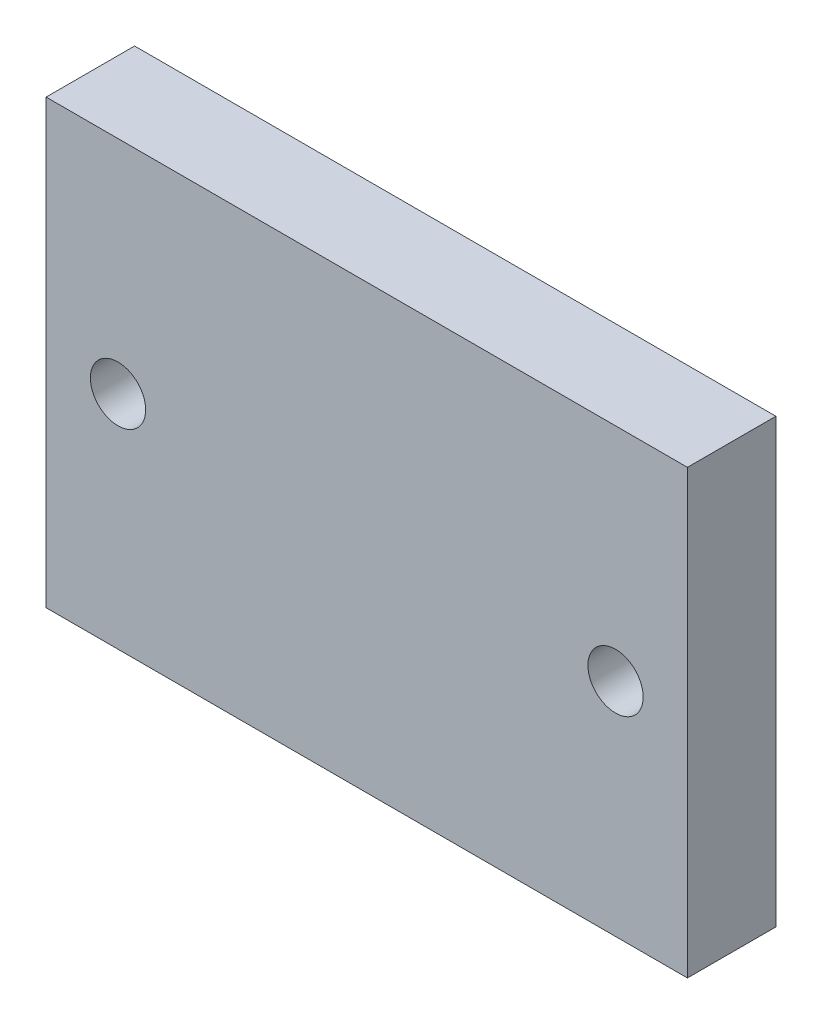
ISO-10303-21;
HEADER;
FILE_DESCRIPTION(('STEP AP214'),'2;1');
FILE_NAME('part.step','',(''),(''),'','','');
FILE_SCHEMA(('AUTOMOTIVE_DESIGN { 1 0 10303 214 1 1 1 1 }'));
ENDSEC;
DATA;
#1=APPLICATION_CONTEXT('core data for automotive mechanical design processes');
#2=APPLICATION_PROTOCOL_DEFINITION('international standard','automotive_design',2000,#1);
#3=PRODUCT_CONTEXT('',#1,'mechanical');
#4=PRODUCT('Part','Part','',(#3));
#5=PRODUCT_RELATED_PRODUCT_CATEGORY('part','',(#4));
#6=PRODUCT_DEFINITION_FORMATION('','',#4);
#7=PRODUCT_DEFINITION_CONTEXT('part definition',#1,'design');
#8=PRODUCT_DEFINITION('design','',#6,#7);
#9=PRODUCT_DEFINITION_SHAPE('','',#8);
#10=(LENGTH_UNIT() NAMED_UNIT(*) SI_UNIT(.MILLI.,.METRE.));
#11=(NAMED_UNIT(*) PLANE_ANGLE_UNIT() SI_UNIT($,.RADIAN.));
#12=(NAMED_UNIT(*) SI_UNIT($,.STERADIAN.) SOLID_ANGLE_UNIT());
#13=UNCERTAINTY_MEASURE_WITH_UNIT(LENGTH_MEASURE(1.E-05),#10,'distance_accuracy_value','');
#14=(GEOMETRIC_REPRESENTATION_CONTEXT(3) GLOBAL_UNCERTAINTY_ASSIGNED_CONTEXT((#13)) GLOBAL_UNIT_ASSIGNED_CONTEXT((#10,
#11,#12)) REPRESENTATION_CONTEXT('',''));
#15=CARTESIAN_POINT('',(0.,0.,0.));
#16=DIRECTION('',(0.,0.,1.));
#17=DIRECTION('',(1.,0.,0.));
#18=AXIS2_PLACEMENT_3D('',#15,#16,#17);
#19=CARTESIAN_POINT('',(-29.,20.,8.));
#20=DIRECTION('',(1.,0.,0.));
#21=DIRECTION('',(0.,1.,0.));
#22=AXIS2_PLACEMENT_3D('',#19,#20,#21);
#23=PLANE('',#22);
#24=DIRECTION('',(0.,-1.,0.));
#25=VECTOR('',#24,1.);
#26=CARTESIAN_POINT('',(-29.,20.,0.));
#27=LINE('',#26,#25);
#28=CARTESIAN_POINT('',(-29.,20.,0.));
#29=VERTEX_POINT('',#28);
#30=CARTESIAN_POINT('',(-29.,-20.,0.));
#31=VERTEX_POINT('',#30);
#32=EDGE_CURVE('E95',#29,#31,#27,.T.);
#33=ORIENTED_EDGE('',*,*,#32,.T.);
#34=DIRECTION('',(0.,0.,-1.));
#35=VECTOR('',#34,1.);
#36=CARTESIAN_POINT('',(-29.,-20.,8.));
#37=LINE('',#36,#35);
#38=CARTESIAN_POINT('',(-29.,-20.,8.));
#39=VERTEX_POINT('',#38);
#40=EDGE_CURVE('E11',#39,#31,#37,.T.);
#41=ORIENTED_EDGE('',*,*,#40,.F.);
#42=DIRECTION('',(0.,-1.,0.));
#43=VECTOR('',#42,1.);
#44=CARTESIAN_POINT('',(-29.,20.,8.));
#45=LINE('',#44,#43);
#46=CARTESIAN_POINT('',(-29.,20.,8.));
#47=VERTEX_POINT('',#46);
#48=EDGE_CURVE('E82',#47,#39,#45,.T.);
#49=ORIENTED_EDGE('',*,*,#48,.F.);
#50=DIRECTION('',(0.,0.,-1.));
#51=VECTOR('',#50,1.);
#52=CARTESIAN_POINT('',(-29.,20.,8.));
#53=LINE('',#52,#51);
#54=EDGE_CURVE('E91',#47,#29,#53,.T.);
#55=ORIENTED_EDGE('',*,*,#54,.T.);
#56=EDGE_LOOP('',(#33,#41,#49,#55));
#57=FACE_BOUND('',#56,.T.);
#58=ADVANCED_FACE('F30',(#57),#23,.F.);
#59=CARTESIAN_POINT('',(-29.,-20.,8.));
#60=DIRECTION('',(0.,1.,0.));
#61=DIRECTION('',(-1.,0.,0.));
#62=AXIS2_PLACEMENT_3D('',#59,#60,#61);
#63=PLANE('',#62);
#64=DIRECTION('',(1.,0.,0.));
#65=VECTOR('',#64,1.);
#66=CARTESIAN_POINT('',(-29.,-20.,0.));
#67=LINE('',#66,#65);
#68=CARTESIAN_POINT('',(29.,-20.,0.));
#69=VERTEX_POINT('',#68);
#70=EDGE_CURVE('E86',#31,#69,#67,.T.);
#71=ORIENTED_EDGE('',*,*,#70,.T.);
#72=DIRECTION('',(0.,0.,-1.));
#73=VECTOR('',#72,1.);
#74=CARTESIAN_POINT('',(29.,-20.,8.));
#75=LINE('',#74,#73);
#76=CARTESIAN_POINT('',(29.,-20.,8.));
#77=VERTEX_POINT('',#76);
#78=EDGE_CURVE('E39',#77,#69,#75,.T.);
#79=ORIENTED_EDGE('',*,*,#78,.F.);
#80=DIRECTION('',(1.,0.,0.));
#81=VECTOR('',#80,1.);
#82=CARTESIAN_POINT('',(-29.,-20.,8.));
#83=LINE('',#82,#81);
#84=EDGE_CURVE('E77',#39,#77,#83,.T.);
#85=ORIENTED_EDGE('',*,*,#84,.F.);
#86=ORIENTED_EDGE('',*,*,#40,.T.);
#87=EDGE_LOOP('',(#71,#79,#85,#86));
#88=FACE_BOUND('',#87,.T.);
#89=ADVANCED_FACE('F85',(#88),#63,.F.);
#90=CARTESIAN_POINT('',(29.,20.,8.));
#91=DIRECTION('',(-1.,0.,0.));
#92=DIRECTION('',(0.,-1.,0.));
#93=AXIS2_PLACEMENT_3D('',#90,#91,#92);
#94=PLANE('',#93);
#95=DIRECTION('',(0.,1.,0.));
#96=VECTOR('',#95,1.);
#97=CARTESIAN_POINT('',(29.,20.,0.));
#98=LINE('',#97,#96);
#99=CARTESIAN_POINT('',(29.,20.,0.));
#100=VERTEX_POINT('',#99);
#101=EDGE_CURVE('E64',#69,#100,#98,.T.);
#102=ORIENTED_EDGE('',*,*,#101,.T.);
#103=DIRECTION('',(0.,0.,-1.));
#104=VECTOR('',#103,1.);
#105=CARTESIAN_POINT('',(29.,20.,8.));
#106=LINE('',#105,#104);
#107=CARTESIAN_POINT('',(29.,20.,8.));
#108=VERTEX_POINT('',#107);
#109=EDGE_CURVE('E87',#108,#100,#106,.T.);
#110=ORIENTED_EDGE('',*,*,#109,.F.);
#111=DIRECTION('',(0.,1.,0.));
#112=VECTOR('',#111,1.);
#113=CARTESIAN_POINT('',(29.,20.,8.));
#114=LINE('',#113,#112);
#115=EDGE_CURVE('E80',#77,#108,#114,.T.);
#116=ORIENTED_EDGE('',*,*,#115,.F.);
#117=ORIENTED_EDGE('',*,*,#78,.T.);
#118=EDGE_LOOP('',(#102,#110,#116,#117));
#119=FACE_BOUND('',#118,.T.);
#120=ADVANCED_FACE('F89',(#119),#94,.F.);
#121=CARTESIAN_POINT('',(-29.,20.,8.));
#122=DIRECTION('',(0.,-1.,0.));
#123=DIRECTION('',(1.,0.,0.));
#124=AXIS2_PLACEMENT_3D('',#121,#122,#123);
#125=PLANE('',#124);
#126=DIRECTION('',(-1.,0.,0.));
#127=VECTOR('',#126,1.);
#128=CARTESIAN_POINT('',(-29.,20.,0.));
#129=LINE('',#128,#127);
#130=EDGE_CURVE('E70',#100,#29,#129,.T.);
#131=ORIENTED_EDGE('',*,*,#130,.T.);
#132=ORIENTED_EDGE('',*,*,#54,.F.);
#133=DIRECTION('',(-1.,0.,0.));
#134=VECTOR('',#133,1.);
#135=CARTESIAN_POINT('',(-29.,20.,8.));
#136=LINE('',#135,#134);
#137=EDGE_CURVE('E47',#108,#47,#136,.T.);
#138=ORIENTED_EDGE('',*,*,#137,.F.);
#139=ORIENTED_EDGE('',*,*,#109,.T.);
#140=EDGE_LOOP('',(#131,#132,#138,#139));
#141=FACE_BOUND('',#140,.T.);
#142=ADVANCED_FACE('F102',(#141),#125,.F.);
#143=CARTESIAN_POINT('',(-29.,-20.,8.));
#144=DIRECTION('',(0.,0.,1.));
#145=DIRECTION('',(1.,0.,0.));
#146=AXIS2_PLACEMENT_3D('',#143,#144,#145);
#147=PLANE('',#146);
#148=CARTESIAN_POINT('',(22.5,0.,8.));
#149=DIRECTION('',(0.,0.,1.));
#150=DIRECTION('',(1.,0.,0.));
#151=AXIS2_PLACEMENT_3D('',#148,#149,#150);
#152=CIRCLE('',#151,2.5);
#153=CARTESIAN_POINT('',(25.,0.,8.));
#154=VERTEX_POINT('',#153);
#155=EDGE_CURVE('E111',#154,#154,#152,.T.);
#156=ORIENTED_EDGE('',*,*,#155,.F.);
#157=EDGE_LOOP('',(#156));
#158=FACE_BOUND('',#157,.T.);
#159=CARTESIAN_POINT('',(-22.5,0.,8.));
#160=DIRECTION('',(0.,0.,1.));
#161=DIRECTION('',(1.,0.,0.));
#162=AXIS2_PLACEMENT_3D('',#159,#160,#161);
#163=CIRCLE('',#162,2.5);
#164=CARTESIAN_POINT('',(-20.,0.,8.));
#165=VERTEX_POINT('',#164);
#166=EDGE_CURVE('E33',#165,#165,#163,.T.);
#167=ORIENTED_EDGE('',*,*,#166,.F.);
#168=EDGE_LOOP('',(#167));
#169=FACE_BOUND('',#168,.T.);
#170=ORIENTED_EDGE('',*,*,#48,.T.);
#171=ORIENTED_EDGE('',*,*,#84,.T.);
#172=ORIENTED_EDGE('',*,*,#115,.T.);
#173=ORIENTED_EDGE('',*,*,#137,.T.);
#174=EDGE_LOOP('',(#170,#171,#172,#173));
#175=FACE_BOUND('',#174,.T.);
#176=ADVANCED_FACE('F78',(#158,#169,#175),#147,.T.);
#177=CARTESIAN_POINT('',(-29.,-20.,0.));
#178=DIRECTION('',(0.,0.,1.));
#179=DIRECTION('',(1.,0.,0.));
#180=AXIS2_PLACEMENT_3D('',#177,#178,#179);
#181=PLANE('',#180);
#182=CARTESIAN_POINT('',(22.5,0.,0.));
#183=DIRECTION('',(0.,0.,-1.));
#184=DIRECTION('',(-1.,0.,0.));
#185=AXIS2_PLACEMENT_3D('',#182,#183,#184);
#186=CIRCLE('',#185,2.5);
#187=CARTESIAN_POINT('',(20.,0.,0.));
#188=VERTEX_POINT('',#187);
#189=EDGE_CURVE('E114',#188,#188,#186,.T.);
#190=ORIENTED_EDGE('',*,*,#189,.F.);
#191=EDGE_LOOP('',(#190));
#192=FACE_BOUND('',#191,.T.);
#193=CARTESIAN_POINT('',(-22.5,0.,0.));
#194=DIRECTION('',(0.,0.,-1.));
#195=DIRECTION('',(-1.,0.,0.));
#196=AXIS2_PLACEMENT_3D('',#193,#194,#195);
#197=CIRCLE('',#196,2.5);
#198=CARTESIAN_POINT('',(-25.,0.,0.));
#199=VERTEX_POINT('',#198);
#200=EDGE_CURVE('E108',#199,#199,#197,.T.);
#201=ORIENTED_EDGE('',*,*,#200,.F.);
#202=EDGE_LOOP('',(#201));
#203=FACE_BOUND('',#202,.T.);
#204=ORIENTED_EDGE('',*,*,#32,.F.);
#205=ORIENTED_EDGE('',*,*,#130,.F.);
#206=ORIENTED_EDGE('',*,*,#101,.F.);
#207=ORIENTED_EDGE('',*,*,#70,.F.);
#208=EDGE_LOOP('',(#204,#205,#206,#207));
#209=FACE_BOUND('',#208,.T.);
#210=ADVANCED_FACE('F105',(#192,#203,#209),#181,.F.);
#211=CARTESIAN_POINT('',(-22.5,0.,0.));
#212=DIRECTION('',(0.,0.,-1.));
#213=DIRECTION('',(-1.,0.,0.));
#214=AXIS2_PLACEMENT_3D('',#211,#212,#213);
#215=CYLINDRICAL_SURFACE('',#214,2.5);
#216=ORIENTED_EDGE('',*,*,#166,.T.);
#217=EDGE_LOOP('',(#216));
#218=FACE_BOUND('',#217,.T.);
#219=ORIENTED_EDGE('',*,*,#200,.T.);
#220=EDGE_LOOP('',(#219));
#221=FACE_BOUND('',#220,.T.);
#222=ADVANCED_FACE('F122',(#218,#221),#215,.F.);
#223=CARTESIAN_POINT('',(22.5,0.,0.));
#224=DIRECTION('',(0.,0.,-1.));
#225=DIRECTION('',(-1.,0.,0.));
#226=AXIS2_PLACEMENT_3D('',#223,#224,#225);
#227=CYLINDRICAL_SURFACE('',#226,2.5);
#228=ORIENTED_EDGE('',*,*,#155,.T.);
#229=EDGE_LOOP('',(#228));
#230=FACE_BOUND('',#229,.T.);
#231=ORIENTED_EDGE('',*,*,#189,.T.);
#232=EDGE_LOOP('',(#231));
#233=FACE_BOUND('',#232,.T.);
#234=ADVANCED_FACE('F118',(#230,#233),#227,.F.);
#235=CLOSED_SHELL('',(#58,#89,#120,#142,#176,#210,#222,#234));
#236=MANIFOLD_SOLID_BREP('B2',#235);
#237=ADVANCED_BREP_SHAPE_REPRESENTATION('',(#18,#236),#14);
#238=SHAPE_DEFINITION_REPRESENTATION(#9,#237);
ENDSEC;
END-ISO-10303-21;
